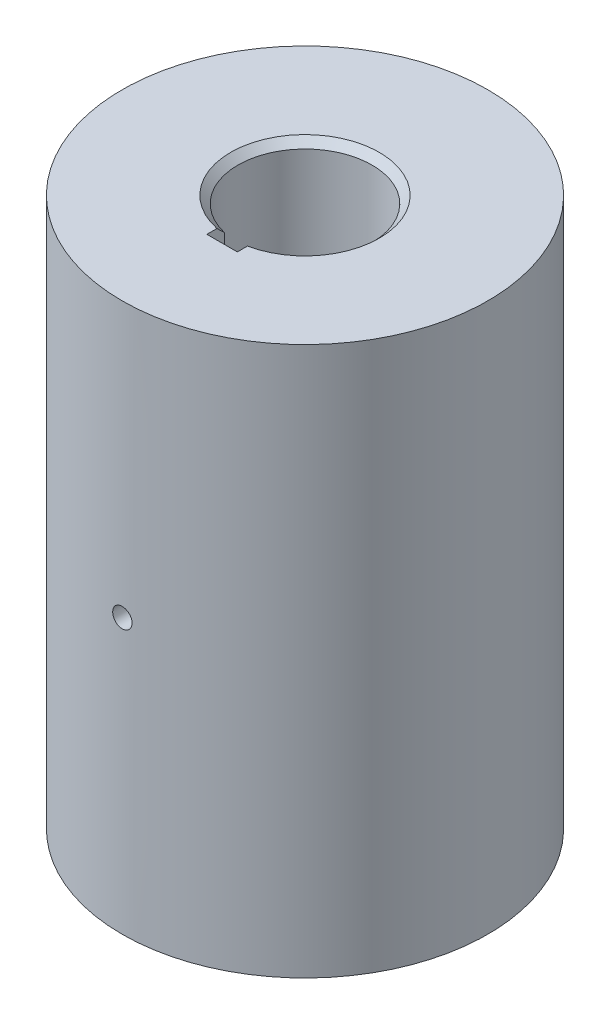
from build123d import *

# Parameters (mm, degrees)
SKETCH1_R                   = 38.1
BOSS_EXTRUDE1_DEPTH         = 114.3
F_3_8_16_TAPPED_HOLE1_D     = 7.9375
F_3_8_16_TAPPED_HOLE1_DEPTH = 23.8252
F_3_8_16_TAPPED_HOLE1_TIP   = 2.384665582
SKETCH4_R                   = 13.97
CUT_EXTRUDE1_DEPTH          = 127.363404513
CHAMFER1_SIZE               = 1.524
SKETCH5_W                   = 6.35
SKETCH5_H                   = 17.272
CUT_EXTRUDE2_DEPTH          = 127.363404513
F_10_32_TAPPED_HOLE1_D      = 4.0386
F_10_32_TAPPED_HOLE1_DEPTH  = 38.1
F_10_32_TAPPED_HOLE1_TIP    = 1.213317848


with BuildPart() as part:
    # Sketch1 → Boss-Extrude1 (new body)
    with BuildSketch(Plane(origin=(0, 0, 0), x_dir=(1, 0, 0), z_dir=(0, 1, 0))):
        with Locations(Location((0, 0, 0), (0, 0, 270))):
            Circle(SKETCH1_R)
    extrude(amount=BOSS_EXTRUDE1_DEPTH)

    # 3_8-16 Tapped Hole1
    with Locations(Plane(origin=(0, 0, 0), x_dir=(-1, 0, 0), z_dir=(0, -1, 0))):
        with Locations((0, -25.4), (-25.4, 0), (0, 25.4), (25.4, 0)):
            Hole(F_3_8_16_TAPPED_HOLE1_D / 2, depth=F_3_8_16_TAPPED_HOLE1_DEPTH)
            with Locations((0, 0, -(F_3_8_16_TAPPED_HOLE1_DEPTH + F_3_8_16_TAPPED_HOLE1_TIP / 2))):  # 118° drill point
                Cone(0, F_3_8_16_TAPPED_HOLE1_D / 2, F_3_8_16_TAPPED_HOLE1_TIP, mode=Mode.SUBTRACT)

    # Sketch4 → Cut-Extrude1 (cut, through all)
    with BuildSketch(Plane(origin=(0, 114.3, 0), x_dir=(1, 0, 0), z_dir=(0, 1, 0))):
        with Locations(Location((0, 0, 0), (0, 0, 270))):
            Circle(SKETCH4_R)
    extrude(amount=-CUT_EXTRUDE1_DEPTH, mode=Mode.SUBTRACT)

    # Chamfer1
    chamfer1_edges = [part.edges().sort_by_distance(p)[0] for p in [
        (0, 114.3, -13.97),
    ]]
    chamfer(chamfer1_edges, length=CHAMFER1_SIZE)

    # Sketch5 → Cut-Extrude2 (cut, through all)
    with BuildSketch(Plane(origin=(0, 114.3, 0), x_dir=(1, 0, 0), z_dir=(0, 1, 0))):
        with Locations((0, -8.636)):
            Rectangle(SKETCH5_W, SKETCH5_H)
    extrude(amount=-CUT_EXTRUDE2_DEPTH, mode=Mode.SUBTRACT)

    # 10-32 Tapped Hole1
    with Locations(Plane(origin=(0, 57.15, 38.1), x_dir=(1, 0, 0), z_dir=(0, 0, 1))):
        with Locations((0, 0)):
            Hole(F_10_32_TAPPED_HOLE1_D / 2, depth=F_10_32_TAPPED_HOLE1_DEPTH)
            with Locations((0, 0, -(F_10_32_TAPPED_HOLE1_DEPTH + F_10_32_TAPPED_HOLE1_TIP / 2))):  # 118° drill point
                Cone(0, F_10_32_TAPPED_HOLE1_D / 2, F_10_32_TAPPED_HOLE1_TIP, mode=Mode.SUBTRACT)


solid = part.part
